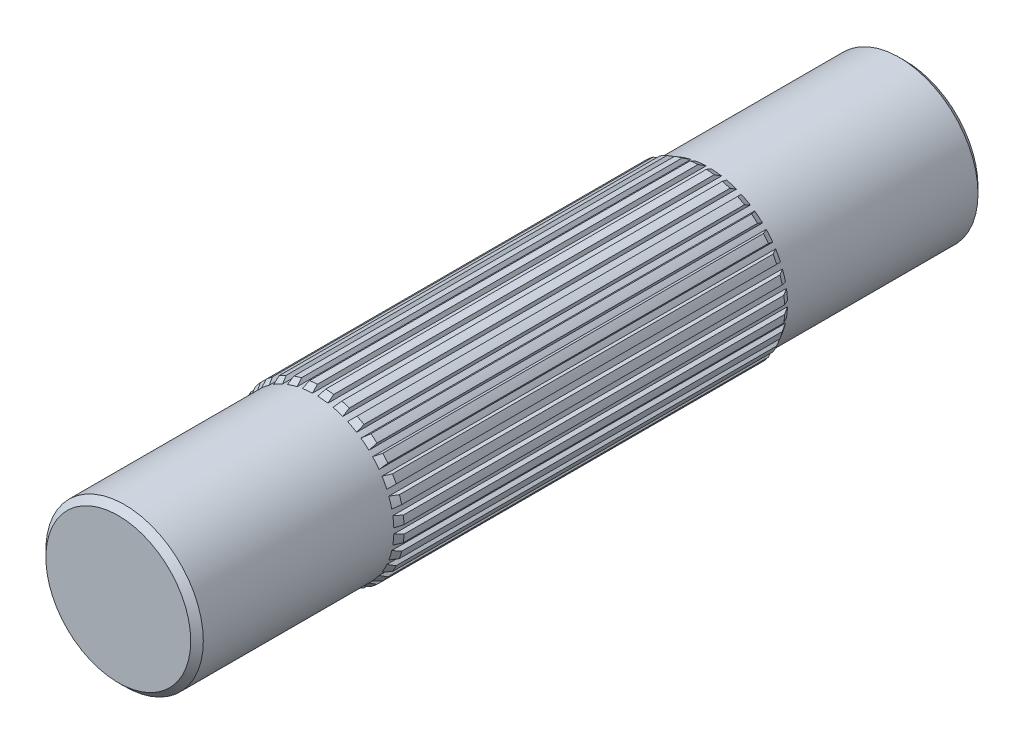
from build123d import *

# Parameters (mm, degrees)
SKETCH1_R           = 3.3274
BOSS_EXTRUDE1_DEPTH = 7.9375
SKETCH3_R           = 3.175
BOSS_EXTRUDE2_DEPTH = 15.875
CUT_EXTRUDE1_DEPTH  = 25.272996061
CIRPATTERN1_COUNT   = 32


with BuildPart() as part:
    # Sketch1 → Boss-Extrude1 (new, symmetric)
    with BuildSketch(Plane.XY):
        Circle(SKETCH1_R)
    extrude(amount=BOSS_EXTRUDE1_DEPTH, both=True)

    # Sketch3 → Boss-Extrude2 (add, symmetric)
    with BuildSketch(Plane.XY):
        Circle(SKETCH3_R)
    extrude(amount=BOSS_EXTRUDE2_DEPTH, both=True)

    # Sketch4 → Cut-Revolve1 (revolve, cut)
    with BuildSketch(Plane(origin=(0, 0, 0), x_dir=(0, 0, -1), z_dir=(1, 0, 0)), mode=Mode.PRIVATE) as cut_revolve1_sk:
        Polygon((-15.875, 3.175), (-15.875, 2.921), (-15.621, 3.175), align=None)
        Polygon((-7.9375, 3.3274), (-7.9375, 3.175), (-7.673535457, 3.3274), align=None)
        Polygon((7.673535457, 3.3274), (7.9375, 3.3274), (7.9375, 3.175), align=None)
        Polygon((15.621, 3.175), (15.875, 3.175), (15.875, 2.921), align=None)
    revolve(cut_revolve1_sk.sketch.rotate(Axis((0, 0, 15.875), (0, 0, -1)), 90), axis=Axis((0, 0, 15.875), (0, 0, -1)), mode=Mode.SUBTRACT)

    # Sketch2 → Cut-Extrude1 (cut, through all)
    with BuildSketch(Plane.XY.offset(7.9375)):
        with BuildLine():
            Line((-0.105704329, 3.173239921), (-0.167805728, 3.32316596))
            ThreePointArc((-0.167805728, 3.32316596), (0, 3.3274), (0.167805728, 3.32316596))
            Line((0.167805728, 3.32316596), (0.105704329, 3.173239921))
            ThreePointArc((0.105704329, 3.173239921), (0, 3.175), (-0.105704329, 3.173239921))
        make_face()
    cut_extrude1 = extrude(amount=-CUT_EXTRUDE1_DEPTH, mode=Mode.SUBTRACT)

    # CirPattern1: Cut-Extrude1 ×32 about axis
    cirpattern1_axis = Axis((0, 0, 0), (0, 0, 1))
    for i in range(1, CIRPATTERN1_COUNT):
        add(cut_extrude1.rotate(cirpattern1_axis, i * 360 / CIRPATTERN1_COUNT), mode=Mode.SUBTRACT)


solid = part.part
